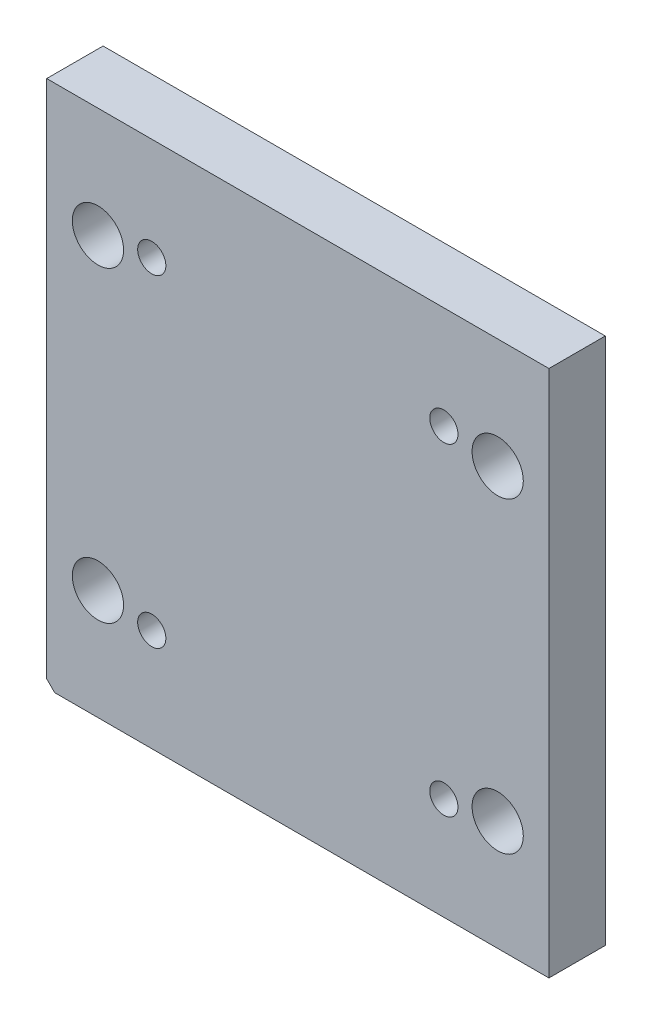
from build123d import *

# Parameters (mm, degrees)
SKETCH1_W            = 196
SKETCH1_H            = 206
BOSS_EXTRUDE1_DEPTH  = 22
DIAMETER_HOLE1_D     = 20
DIAMETER_HOLE1_DEPTH = 22
DIAMETER_HOLE1_TIP   = 6.00860619
HOLE1_D              = 11
HOLE1_CBORE_D        = 18
HOLE1_CBORE_DEPTH    = 13
SKETCH6_R            = 45
CUT_EXTRUDE1_DEPTH   = 4.05
CHAMFER1_SIZE        = 3.12


with BuildPart() as part:
    # Sketch1 → Boss-Extrude1 (new body)
    with BuildSketch(Plane.XY):
        Rectangle(SKETCH1_W, SKETCH1_H)
    extrude(amount=-BOSS_EXTRUDE1_DEPTH)

    # Diameter Hole1
    with Locations(Plane(origin=(-522.991452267, 0, 0), x_dir=(1, 0, 0), z_dir=(0, 0, 1))):
        with Locations((600.991452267, -60), (444.991452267, -60), (444.991452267, 60), (600.991452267, 60)):
            Hole(DIAMETER_HOLE1_D / 2, depth=DIAMETER_HOLE1_DEPTH)
            with Locations((0, 0, -(DIAMETER_HOLE1_DEPTH + DIAMETER_HOLE1_TIP / 2))):  # 118° drill point
                Cone(0, DIAMETER_HOLE1_D / 2, DIAMETER_HOLE1_TIP, mode=Mode.SUBTRACT)

    # Hole1 (through all)
    with Locations(Plane(origin=(0, 0, -22), x_dir=(1, 0, 0), z_dir=(0, 0, -1))):
        with Locations((57, 63), (-57, 63), (-57, -63), (57, -63)):
            CounterBoreHole(HOLE1_D / 2, HOLE1_CBORE_D / 2, HOLE1_CBORE_DEPTH)

    # Sketch6 → Cut-Extrude1 (cut)
    with BuildSketch(Plane.XY.offset(-22)):
        Circle(SKETCH6_R)
    extrude(amount=CUT_EXTRUDE1_DEPTH, mode=Mode.SUBTRACT)

    # Chamfer1
    chamfer1_edges = [part.edges().sort_by_distance(p)[0] for p in [
        (-98, -103, -11),
    ]]
    chamfer(chamfer1_edges, length=CHAMFER1_SIZE)


solid = part.part
